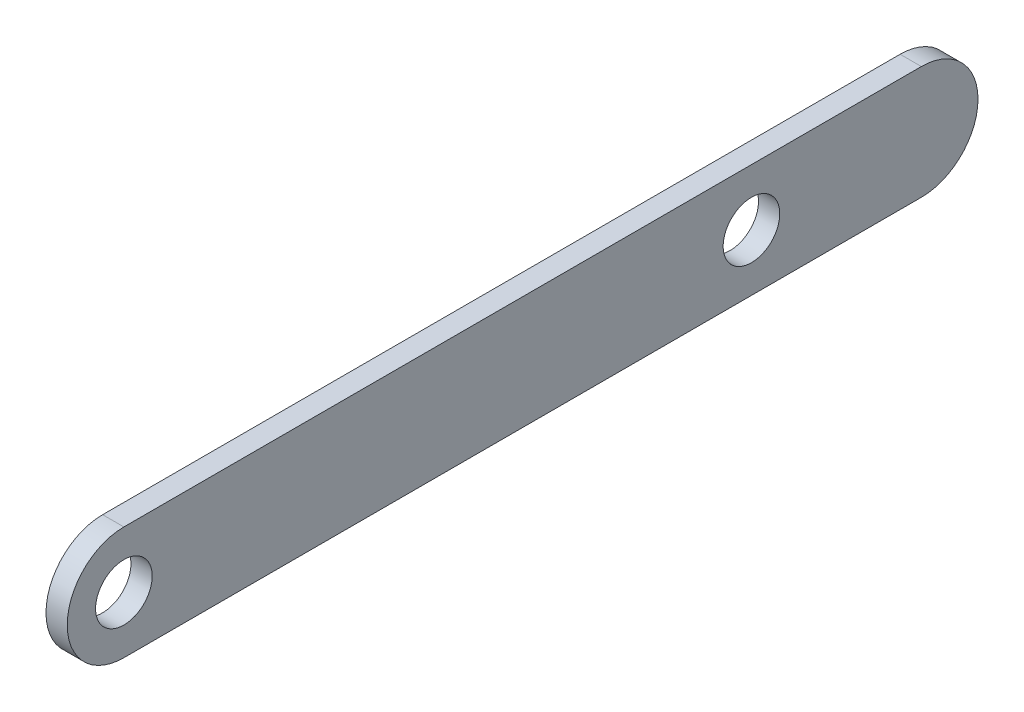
ISO-10303-21;
HEADER;
FILE_DESCRIPTION(('STEP AP214'),'2;1');
FILE_NAME('part.step','',(''),(''),'','','');
FILE_SCHEMA(('AUTOMOTIVE_DESIGN { 1 0 10303 214 1 1 1 1 }'));
ENDSEC;
DATA;
#1=APPLICATION_CONTEXT('core data for automotive mechanical design processes');
#2=APPLICATION_PROTOCOL_DEFINITION('international standard','automotive_design',2000,#1);
#3=PRODUCT_CONTEXT('',#1,'mechanical');
#4=PRODUCT('Part','Part','',(#3));
#5=PRODUCT_RELATED_PRODUCT_CATEGORY('part','',(#4));
#6=PRODUCT_DEFINITION_FORMATION('','',#4);
#7=PRODUCT_DEFINITION_CONTEXT('part definition',#1,'design');
#8=PRODUCT_DEFINITION('design','',#6,#7);
#9=PRODUCT_DEFINITION_SHAPE('','',#8);
#10=(LENGTH_UNIT() NAMED_UNIT(*) SI_UNIT(.MILLI.,.METRE.));
#11=(NAMED_UNIT(*) PLANE_ANGLE_UNIT() SI_UNIT($,.RADIAN.));
#12=(NAMED_UNIT(*) SI_UNIT($,.STERADIAN.) SOLID_ANGLE_UNIT());
#13=UNCERTAINTY_MEASURE_WITH_UNIT(LENGTH_MEASURE(1.E-05),#10,'distance_accuracy_value','');
#14=(GEOMETRIC_REPRESENTATION_CONTEXT(3) GLOBAL_UNCERTAINTY_ASSIGNED_CONTEXT((#13)) GLOBAL_UNIT_ASSIGNED_CONTEXT((#10,
#11,#12)) REPRESENTATION_CONTEXT('',''));
#15=CARTESIAN_POINT('',(0.,0.,0.));
#16=DIRECTION('',(0.,0.,1.));
#17=DIRECTION('',(1.,0.,0.));
#18=AXIS2_PLACEMENT_3D('',#15,#16,#17);
#19=CARTESIAN_POINT('',(4.7625,0.,70.358));
#20=DIRECTION('',(1.,0.,0.));
#21=DIRECTION('',(0.,0.,-1.));
#22=AXIS2_PLACEMENT_3D('',#19,#20,#21);
#23=PLANE('',#22);
#24=CARTESIAN_POINT('',(4.7625,0.,-70.358));
#25=DIRECTION('',(1.,0.,0.));
#26=DIRECTION('',(0.,0.,-1.));
#27=AXIS2_PLACEMENT_3D('',#24,#25,#26);
#28=CIRCLE('',#27,6.35);
#29=CARTESIAN_POINT('',(4.7625,0.,-64.008));
#30=VERTEX_POINT('',#29);
#31=EDGE_CURVE('E104',#30,#30,#28,.T.);
#32=ORIENTED_EDGE('',*,*,#31,.F.);
#33=EDGE_LOOP('',(#32));
#34=FACE_BOUND('',#33,.T.);
#35=CARTESIAN_POINT('',(4.7625,0.,70.358));
#36=DIRECTION('',(1.,0.,0.));
#37=DIRECTION('',(0.,0.,-1.));
#38=AXIS2_PLACEMENT_3D('',#35,#36,#37);
#39=CIRCLE('',#38,12.7);
#40=CARTESIAN_POINT('',(4.7625,12.7,70.358));
#41=VERTEX_POINT('',#40);
#42=CARTESIAN_POINT('',(4.7625,-12.7,70.358));
#43=VERTEX_POINT('',#42);
#44=EDGE_CURVE('E87',#41,#43,#39,.T.);
#45=ORIENTED_EDGE('',*,*,#44,.T.);
#46=DIRECTION('',(0.,0.,-1.));
#47=VECTOR('',#46,1.);
#48=CARTESIAN_POINT('',(4.7625,-12.7,70.358));
#49=LINE('',#48,#47);
#50=CARTESIAN_POINT('',(4.7625,-12.7,-108.458));
#51=VERTEX_POINT('',#50);
#52=EDGE_CURVE('E81',#43,#51,#49,.T.);
#53=ORIENTED_EDGE('',*,*,#52,.T.);
#54=CARTESIAN_POINT('',(4.7625,0.,-108.458));
#55=DIRECTION('',(1.,0.,0.));
#56=DIRECTION('',(0.,0.,1.));
#57=AXIS2_PLACEMENT_3D('',#54,#55,#56);
#58=CIRCLE('',#57,12.7);
#59=CARTESIAN_POINT('',(4.7625,12.7,-108.458));
#60=VERTEX_POINT('',#59);
#61=EDGE_CURVE('E84',#51,#60,#58,.T.);
#62=ORIENTED_EDGE('',*,*,#61,.T.);
#63=DIRECTION('',(0.,0.,1.));
#64=VECTOR('',#63,1.);
#65=CARTESIAN_POINT('',(4.7625,12.7,-70.358));
#66=LINE('',#65,#64);
#67=EDGE_CURVE('E53',#60,#41,#66,.T.);
#68=ORIENTED_EDGE('',*,*,#67,.T.);
#69=EDGE_LOOP('',(#45,#53,#62,#68));
#70=FACE_BOUND('',#69,.T.);
#71=CARTESIAN_POINT('',(4.7625,0.,70.358));
#72=DIRECTION('',(1.,0.,0.));
#73=DIRECTION('',(0.,0.,-1.));
#74=AXIS2_PLACEMENT_3D('',#71,#72,#73);
#75=CIRCLE('',#74,6.35000000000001);
#76=CARTESIAN_POINT('',(4.7625,0.,76.708));
#77=VERTEX_POINT('',#76);
#78=EDGE_CURVE('E116',#77,#77,#75,.T.);
#79=ORIENTED_EDGE('',*,*,#78,.F.);
#80=EDGE_LOOP('',(#79));
#81=FACE_BOUND('',#80,.T.);
#82=ADVANCED_FACE('F36',(#34,#70,#81),#23,.T.);
#83=CARTESIAN_POINT('',(0.,0.,70.358));
#84=DIRECTION('',(1.,0.,0.));
#85=DIRECTION('',(0.,0.,-1.));
#86=AXIS2_PLACEMENT_3D('',#83,#84,#85);
#87=PLANE('',#86);
#88=CARTESIAN_POINT('',(0.,0.,70.358));
#89=DIRECTION('',(1.,0.,0.));
#90=DIRECTION('',(0.,0.,-1.));
#91=AXIS2_PLACEMENT_3D('',#88,#89,#90);
#92=CIRCLE('',#91,12.7);
#93=CARTESIAN_POINT('',(0.,12.7,70.358));
#94=VERTEX_POINT('',#93);
#95=CARTESIAN_POINT('',(0.,-12.7,70.358));
#96=VERTEX_POINT('',#95);
#97=EDGE_CURVE('E101',#94,#96,#92,.T.);
#98=ORIENTED_EDGE('',*,*,#97,.F.);
#99=DIRECTION('',(0.,0.,1.));
#100=VECTOR('',#99,1.);
#101=CARTESIAN_POINT('',(0.,12.7,70.358));
#102=LINE('',#101,#100);
#103=CARTESIAN_POINT('',(0.,12.7,-108.458));
#104=VERTEX_POINT('',#103);
#105=EDGE_CURVE('E70',#104,#94,#102,.T.);
#106=ORIENTED_EDGE('',*,*,#105,.F.);
#107=CARTESIAN_POINT('',(0.,0.,-108.458));
#108=DIRECTION('',(1.,0.,0.));
#109=DIRECTION('',(0.,0.,1.));
#110=AXIS2_PLACEMENT_3D('',#107,#108,#109);
#111=CIRCLE('',#110,12.7);
#112=CARTESIAN_POINT('',(0.,-12.7,-108.458));
#113=VERTEX_POINT('',#112);
#114=EDGE_CURVE('E106',#113,#104,#111,.T.);
#115=ORIENTED_EDGE('',*,*,#114,.F.);
#116=DIRECTION('',(0.,0.,-1.));
#117=VECTOR('',#116,1.);
#118=CARTESIAN_POINT('',(0.,-12.7,-108.458));
#119=LINE('',#118,#117);
#120=EDGE_CURVE('E92',#96,#113,#119,.T.);
#121=ORIENTED_EDGE('',*,*,#120,.F.);
#122=EDGE_LOOP('',(#98,#106,#115,#121));
#123=FACE_BOUND('',#122,.T.);
#124=CARTESIAN_POINT('',(0.,0.,-70.358));
#125=DIRECTION('',(1.,0.,0.));
#126=DIRECTION('',(0.,0.,-1.));
#127=AXIS2_PLACEMENT_3D('',#124,#125,#126);
#128=CIRCLE('',#127,6.35);
#129=CARTESIAN_POINT('',(0.,0.,-64.008));
#130=VERTEX_POINT('',#129);
#131=EDGE_CURVE('E113',#130,#130,#128,.T.);
#132=ORIENTED_EDGE('',*,*,#131,.T.);
#133=EDGE_LOOP('',(#132));
#134=FACE_BOUND('',#133,.T.);
#135=CARTESIAN_POINT('',(0.,0.,70.358));
#136=DIRECTION('',(1.,0.,0.));
#137=DIRECTION('',(0.,0.,-1.));
#138=AXIS2_PLACEMENT_3D('',#135,#136,#137);
#139=CIRCLE('',#138,6.35000000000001);
#140=CARTESIAN_POINT('',(0.,0.,76.708));
#141=VERTEX_POINT('',#140);
#142=EDGE_CURVE('E119',#141,#141,#139,.T.);
#143=ORIENTED_EDGE('',*,*,#142,.T.);
#144=EDGE_LOOP('',(#143));
#145=FACE_BOUND('',#144,.T.);
#146=ADVANCED_FACE('F128',(#123,#134,#145),#87,.F.);
#147=CARTESIAN_POINT('',(4.7625,0.,70.358));
#148=DIRECTION('',(-1.,0.,0.));
#149=DIRECTION('',(0.,0.,1.));
#150=AXIS2_PLACEMENT_3D('',#147,#148,#149);
#151=CYLINDRICAL_SURFACE('',#150,12.7);
#152=ORIENTED_EDGE('',*,*,#97,.T.);
#153=DIRECTION('',(-1.,0.,0.));
#154=VECTOR('',#153,1.);
#155=CARTESIAN_POINT('',(4.7625,-12.7,70.358));
#156=LINE('',#155,#154);
#157=EDGE_CURVE('E11',#43,#96,#156,.T.);
#158=ORIENTED_EDGE('',*,*,#157,.F.);
#159=ORIENTED_EDGE('',*,*,#44,.F.);
#160=DIRECTION('',(-1.,0.,0.));
#161=VECTOR('',#160,1.);
#162=CARTESIAN_POINT('',(4.7625,12.7,70.358));
#163=LINE('',#162,#161);
#164=EDGE_CURVE('E97',#41,#94,#163,.T.);
#165=ORIENTED_EDGE('',*,*,#164,.T.);
#166=EDGE_LOOP('',(#152,#158,#159,#165));
#167=FACE_BOUND('',#166,.T.);
#168=ADVANCED_FACE('F38',(#167),#151,.T.);
#169=CARTESIAN_POINT('',(4.7625,-12.7,-108.458));
#170=DIRECTION('',(0.,1.,0.));
#171=DIRECTION('',(0.,0.,1.));
#172=AXIS2_PLACEMENT_3D('',#169,#170,#171);
#173=PLANE('',#172);
#174=ORIENTED_EDGE('',*,*,#120,.T.);
#175=DIRECTION('',(-1.,0.,0.));
#176=VECTOR('',#175,1.);
#177=CARTESIAN_POINT('',(4.7625,-12.7,-108.458));
#178=LINE('',#177,#176);
#179=EDGE_CURVE('E45',#51,#113,#178,.T.);
#180=ORIENTED_EDGE('',*,*,#179,.F.);
#181=ORIENTED_EDGE('',*,*,#52,.F.);
#182=ORIENTED_EDGE('',*,*,#157,.T.);
#183=EDGE_LOOP('',(#174,#180,#181,#182));
#184=FACE_BOUND('',#183,.T.);
#185=ADVANCED_FACE('F91',(#184),#173,.F.);
#186=CARTESIAN_POINT('',(4.7625,0.,-108.458));
#187=DIRECTION('',(-1.,0.,0.));
#188=DIRECTION('',(0.,0.,1.));
#189=AXIS2_PLACEMENT_3D('',#186,#187,#188);
#190=CYLINDRICAL_SURFACE('',#189,12.7);
#191=ORIENTED_EDGE('',*,*,#114,.T.);
#192=DIRECTION('',(-1.,0.,0.));
#193=VECTOR('',#192,1.);
#194=CARTESIAN_POINT('',(4.7625,12.7,-108.458));
#195=LINE('',#194,#193);
#196=EDGE_CURVE('E94',#60,#104,#195,.T.);
#197=ORIENTED_EDGE('',*,*,#196,.F.);
#198=ORIENTED_EDGE('',*,*,#61,.F.);
#199=ORIENTED_EDGE('',*,*,#179,.T.);
#200=EDGE_LOOP('',(#191,#197,#198,#199));
#201=FACE_BOUND('',#200,.T.);
#202=ADVANCED_FACE('F95',(#201),#190,.T.);
#203=CARTESIAN_POINT('',(4.7625,12.7,70.358));
#204=DIRECTION('',(0.,-1.,0.));
#205=DIRECTION('',(0.,0.,-1.));
#206=AXIS2_PLACEMENT_3D('',#203,#204,#205);
#207=PLANE('',#206);
#208=ORIENTED_EDGE('',*,*,#105,.T.);
#209=ORIENTED_EDGE('',*,*,#164,.F.);
#210=ORIENTED_EDGE('',*,*,#67,.F.);
#211=ORIENTED_EDGE('',*,*,#196,.T.);
#212=EDGE_LOOP('',(#208,#209,#210,#211));
#213=FACE_BOUND('',#212,.T.);
#214=ADVANCED_FACE('F110',(#213),#207,.F.);
#215=CARTESIAN_POINT('',(4.7625,0.,-70.358));
#216=DIRECTION('',(-1.,0.,0.));
#217=DIRECTION('',(0.,0.,1.));
#218=AXIS2_PLACEMENT_3D('',#215,#216,#217);
#219=CYLINDRICAL_SURFACE('',#218,6.35);
#220=CARTESIAN_POINT('',(4.7625,0.,-64.008));
#221=CARTESIAN_POINT('',(4.712890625,0.,-64.008));
#222=CARTESIAN_POINT('',(4.66328125,0.,-64.008));
#223=CARTESIAN_POINT('',(4.5640625,0.,-64.008));
#224=CARTESIAN_POINT('',(4.514453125,0.,-64.008));
#225=CARTESIAN_POINT('',(4.415234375,0.,-64.008));
#226=CARTESIAN_POINT('',(4.365625,0.,-64.008));
#227=CARTESIAN_POINT('',(4.26640625,0.,-64.008));
#228=CARTESIAN_POINT('',(4.216796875,0.,-64.008));
#229=CARTESIAN_POINT('',(4.117578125,0.,-64.008));
#230=CARTESIAN_POINT('',(4.06796875,0.,-64.008));
#231=CARTESIAN_POINT('',(3.96875,0.,-64.008));
#232=CARTESIAN_POINT('',(3.919140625,0.,-64.008));
#233=CARTESIAN_POINT('',(3.819921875,0.,-64.008));
#234=CARTESIAN_POINT('',(3.7703125,0.,-64.008));
#235=CARTESIAN_POINT('',(3.67109375,0.,-64.008));
#236=CARTESIAN_POINT('',(3.621484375,0.,-64.008));
#237=CARTESIAN_POINT('',(3.522265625,0.,-64.008));
#238=CARTESIAN_POINT('',(3.47265625,0.,-64.008));
#239=CARTESIAN_POINT('',(3.3734375,0.,-64.008));
#240=CARTESIAN_POINT('',(3.323828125,0.,-64.008));
#241=CARTESIAN_POINT('',(3.224609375,0.,-64.008));
#242=CARTESIAN_POINT('',(3.175,0.,-64.008));
#243=CARTESIAN_POINT('',(3.07578125,0.,-64.008));
#244=CARTESIAN_POINT('',(3.026171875,0.,-64.008));
#245=CARTESIAN_POINT('',(2.926953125,0.,-64.008));
#246=CARTESIAN_POINT('',(2.87734375,0.,-64.008));
#247=CARTESIAN_POINT('',(2.778125,0.,-64.008));
#248=CARTESIAN_POINT('',(2.728515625,0.,-64.008));
#249=CARTESIAN_POINT('',(2.629296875,0.,-64.008));
#250=CARTESIAN_POINT('',(2.5796875,0.,-64.008));
#251=CARTESIAN_POINT('',(2.48046875,0.,-64.008));
#252=CARTESIAN_POINT('',(2.430859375,0.,-64.008));
#253=CARTESIAN_POINT('',(2.331640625,0.,-64.008));
#254=CARTESIAN_POINT('',(2.28203125,0.,-64.008));
#255=CARTESIAN_POINT('',(2.1828125,0.,-64.008));
#256=CARTESIAN_POINT('',(2.133203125,0.,-64.008));
#257=CARTESIAN_POINT('',(2.033984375,0.,-64.008));
#258=CARTESIAN_POINT('',(1.984375,0.,-64.008));
#259=CARTESIAN_POINT('',(1.88515625,0.,-64.008));
#260=CARTESIAN_POINT('',(1.835546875,0.,-64.008));
#261=CARTESIAN_POINT('',(1.736328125,0.,-64.008));
#262=CARTESIAN_POINT('',(1.68671875,0.,-64.008));
#263=CARTESIAN_POINT('',(1.5875,0.,-64.008));
#264=CARTESIAN_POINT('',(1.537890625,0.,-64.008));
#265=CARTESIAN_POINT('',(1.438671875,0.,-64.008));
#266=CARTESIAN_POINT('',(1.3890625,0.,-64.008));
#267=CARTESIAN_POINT('',(1.28984375,0.,-64.008));
#268=CARTESIAN_POINT('',(1.240234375,0.,-64.008));
#269=CARTESIAN_POINT('',(1.141015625,0.,-64.008));
#270=CARTESIAN_POINT('',(1.09140625,0.,-64.008));
#271=CARTESIAN_POINT('',(0.992187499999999,0.,-64.008));
#272=CARTESIAN_POINT('',(0.942578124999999,0.,-64.008));
#273=CARTESIAN_POINT('',(0.843359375,0.,-64.008));
#274=CARTESIAN_POINT('',(0.79375,0.,-64.008));
#275=CARTESIAN_POINT('',(0.69453125,0.,-64.008));
#276=CARTESIAN_POINT('',(0.644921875,0.,-64.008));
#277=CARTESIAN_POINT('',(0.545703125,0.,-64.008));
#278=CARTESIAN_POINT('',(0.49609375,0.,-64.008));
#279=CARTESIAN_POINT('',(0.396875,0.,-64.008));
#280=CARTESIAN_POINT('',(0.347265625,0.,-64.008));
#281=CARTESIAN_POINT('',(0.248046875,0.,-64.008));
#282=CARTESIAN_POINT('',(0.1984375,0.,-64.008));
#283=CARTESIAN_POINT('',(0.09921875,0.,-64.008));
#284=CARTESIAN_POINT('',(0.049609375,0.,-64.008));
#285=CARTESIAN_POINT('',(0.,0.,-64.008));
#286=B_SPLINE_CURVE_WITH_KNOTS('',3,(#220,#221,#222,#223,#224,#225,#226,#227,#228,#229,#230,
#231,#232,#233,#234,#235,#236,#237,#238,#239,#240,#241,#242,#243,#244,#245,#246,#247,#248,#249,
#250,#251,#252,#253,#254,#255,#256,#257,#258,#259,#260,#261,#262,#263,#264,#265,#266,#267,#268,
#269,#270,#271,#272,#273,#274,#275,#276,#277,#278,#279,#280,#281,#282,#283,#284,#285),
.UNSPECIFIED.,.F.,.F.,(4,2,2,2,2,2,2,2,2,2,2,2,2,2,2,2,2,2,2,2,2,2,2,2,2,2,2,2,2,2,2,2,4),(0.,
0.148828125,0.29765625,0.446484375,0.5953125,0.744140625,0.892968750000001,1.041796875,1.190625,
1.339453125,1.48828125,1.637109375,1.7859375,1.934765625,2.08359375,2.232421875,2.38125,
2.530078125,2.67890625,2.827734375,2.9765625,3.125390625,3.27421875,3.423046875,3.571875,
3.720703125,3.86953125,4.018359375,4.1671875,4.316015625,4.46484375,4.613671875,4.7625),.UNSPECIFIED.);
#287=EDGE_CURVE('BSEAM137',#30,#130,#286,.T.);
#288=ORIENTED_EDGE('',*,*,#31,.T.);
#289=ORIENTED_EDGE('',*,*,#131,.F.);
#290=ORIENTED_EDGE('',*,*,#287,.T.);
#291=ORIENTED_EDGE('',*,*,#287,.F.);
#292=EDGE_LOOP('',(#288,#290,#289,#291));
#293=FACE_BOUND('',#292,.T.);
#294=ADVANCED_FACE('F137',(#293),#219,.F.);
#295=CARTESIAN_POINT('',(4.7625,0.,70.358));
#296=DIRECTION('',(-1.,0.,0.));
#297=DIRECTION('',(0.,0.,1.));
#298=AXIS2_PLACEMENT_3D('',#295,#296,#297);
#299=CYLINDRICAL_SURFACE('',#298,6.35000000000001);
#300=CARTESIAN_POINT('',(4.7625,0.,76.708));
#301=CARTESIAN_POINT('',(4.712890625,0.,76.708));
#302=CARTESIAN_POINT('',(4.66328125,0.,76.708));
#303=CARTESIAN_POINT('',(4.5640625,0.,76.708));
#304=CARTESIAN_POINT('',(4.514453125,0.,76.708));
#305=CARTESIAN_POINT('',(4.415234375,0.,76.708));
#306=CARTESIAN_POINT('',(4.365625,0.,76.708));
#307=CARTESIAN_POINT('',(4.26640625,0.,76.708));
#308=CARTESIAN_POINT('',(4.216796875,0.,76.708));
#309=CARTESIAN_POINT('',(4.117578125,0.,76.708));
#310=CARTESIAN_POINT('',(4.06796875,0.,76.708));
#311=CARTESIAN_POINT('',(3.96875,0.,76.708));
#312=CARTESIAN_POINT('',(3.919140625,0.,76.708));
#313=CARTESIAN_POINT('',(3.819921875,0.,76.708));
#314=CARTESIAN_POINT('',(3.7703125,0.,76.708));
#315=CARTESIAN_POINT('',(3.67109375,0.,76.708));
#316=CARTESIAN_POINT('',(3.621484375,0.,76.708));
#317=CARTESIAN_POINT('',(3.522265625,0.,76.708));
#318=CARTESIAN_POINT('',(3.47265625,0.,76.708));
#319=CARTESIAN_POINT('',(3.3734375,0.,76.708));
#320=CARTESIAN_POINT('',(3.323828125,0.,76.708));
#321=CARTESIAN_POINT('',(3.224609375,0.,76.708));
#322=CARTESIAN_POINT('',(3.175,0.,76.708));
#323=CARTESIAN_POINT('',(3.07578125,0.,76.708));
#324=CARTESIAN_POINT('',(3.026171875,0.,76.708));
#325=CARTESIAN_POINT('',(2.926953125,0.,76.708));
#326=CARTESIAN_POINT('',(2.87734375,0.,76.708));
#327=CARTESIAN_POINT('',(2.778125,0.,76.708));
#328=CARTESIAN_POINT('',(2.728515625,0.,76.708));
#329=CARTESIAN_POINT('',(2.629296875,0.,76.708));
#330=CARTESIAN_POINT('',(2.5796875,0.,76.708));
#331=CARTESIAN_POINT('',(2.48046875,0.,76.708));
#332=CARTESIAN_POINT('',(2.430859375,0.,76.708));
#333=CARTESIAN_POINT('',(2.331640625,0.,76.708));
#334=CARTESIAN_POINT('',(2.28203125,0.,76.708));
#335=CARTESIAN_POINT('',(2.1828125,0.,76.708));
#336=CARTESIAN_POINT('',(2.133203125,0.,76.708));
#337=CARTESIAN_POINT('',(2.033984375,0.,76.708));
#338=CARTESIAN_POINT('',(1.984375,0.,76.708));
#339=CARTESIAN_POINT('',(1.88515625,0.,76.708));
#340=CARTESIAN_POINT('',(1.835546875,0.,76.708));
#341=CARTESIAN_POINT('',(1.736328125,0.,76.708));
#342=CARTESIAN_POINT('',(1.68671875,0.,76.708));
#343=CARTESIAN_POINT('',(1.5875,0.,76.708));
#344=CARTESIAN_POINT('',(1.537890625,0.,76.708));
#345=CARTESIAN_POINT('',(1.438671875,0.,76.708));
#346=CARTESIAN_POINT('',(1.3890625,0.,76.708));
#347=CARTESIAN_POINT('',(1.28984375,0.,76.708));
#348=CARTESIAN_POINT('',(1.240234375,0.,76.708));
#349=CARTESIAN_POINT('',(1.141015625,0.,76.708));
#350=CARTESIAN_POINT('',(1.09140625,0.,76.708));
#351=CARTESIAN_POINT('',(0.992187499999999,0.,76.708));
#352=CARTESIAN_POINT('',(0.942578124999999,0.,76.708));
#353=CARTESIAN_POINT('',(0.843359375,0.,76.708));
#354=CARTESIAN_POINT('',(0.79375,0.,76.708));
#355=CARTESIAN_POINT('',(0.69453125,0.,76.708));
#356=CARTESIAN_POINT('',(0.644921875,0.,76.708));
#357=CARTESIAN_POINT('',(0.545703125,0.,76.708));
#358=CARTESIAN_POINT('',(0.49609375,0.,76.708));
#359=CARTESIAN_POINT('',(0.396875,0.,76.708));
#360=CARTESIAN_POINT('',(0.347265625,0.,76.708));
#361=CARTESIAN_POINT('',(0.248046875,0.,76.708));
#362=CARTESIAN_POINT('',(0.1984375,0.,76.708));
#363=CARTESIAN_POINT('',(0.09921875,0.,76.708));
#364=CARTESIAN_POINT('',(0.049609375,0.,76.708));
#365=CARTESIAN_POINT('',(0.,0.,76.708));
#366=B_SPLINE_CURVE_WITH_KNOTS('',3,(#300,#301,#302,#303,#304,#305,#306,#307,#308,#309,#310,
#311,#312,#313,#314,#315,#316,#317,#318,#319,#320,#321,#322,#323,#324,#325,#326,#327,#328,#329,
#330,#331,#332,#333,#334,#335,#336,#337,#338,#339,#340,#341,#342,#343,#344,#345,#346,#347,#348,
#349,#350,#351,#352,#353,#354,#355,#356,#357,#358,#359,#360,#361,#362,#363,#364,#365),
.UNSPECIFIED.,.F.,.F.,(4,2,2,2,2,2,2,2,2,2,2,2,2,2,2,2,2,2,2,2,2,2,2,2,2,2,2,2,2,2,2,2,4),(0.,
0.148828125,0.29765625,0.446484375,0.5953125,0.744140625,0.892968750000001,1.041796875,1.190625,
1.339453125,1.48828125,1.637109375,1.7859375,1.934765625,2.08359375,2.232421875,2.38125,
2.530078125,2.67890625,2.827734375,2.9765625,3.125390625,3.27421875,3.423046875,3.571875,
3.720703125,3.86953125,4.018359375,4.1671875,4.316015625,4.46484375,4.613671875,4.7625),.UNSPECIFIED.);
#367=EDGE_CURVE('BSEAM125',#77,#141,#366,.T.);
#368=ORIENTED_EDGE('',*,*,#78,.T.);
#369=ORIENTED_EDGE('',*,*,#142,.F.);
#370=ORIENTED_EDGE('',*,*,#367,.T.);
#371=ORIENTED_EDGE('',*,*,#367,.F.);
#372=EDGE_LOOP('',(#368,#370,#369,#371));
#373=FACE_BOUND('',#372,.T.);
#374=ADVANCED_FACE('F125',(#373),#299,.F.);
#375=CLOSED_SHELL('',(#82,#146,#168,#185,#202,#214,#294,#374));
#376=MANIFOLD_SOLID_BREP('B2',#375);
#377=ADVANCED_BREP_SHAPE_REPRESENTATION('',(#18,#376),#14);
#378=SHAPE_DEFINITION_REPRESENTATION(#9,#377);
ENDSEC;
END-ISO-10303-21;
